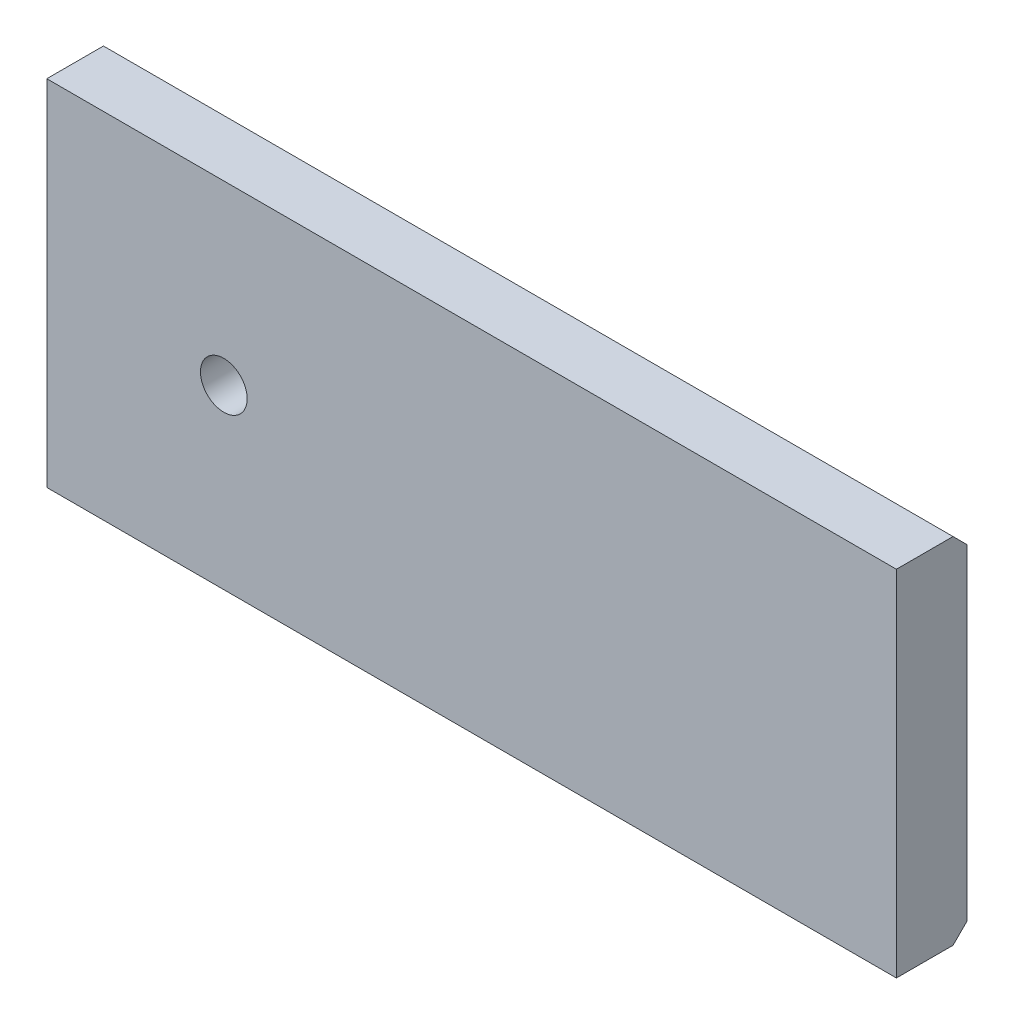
ISO-10303-21;
HEADER;
FILE_DESCRIPTION(('STEP AP214'),'2;1');
FILE_NAME('part.step','',(''),(''),'','','');
FILE_SCHEMA(('AUTOMOTIVE_DESIGN { 1 0 10303 214 1 1 1 1 }'));
ENDSEC;
DATA;
#1=APPLICATION_CONTEXT('core data for automotive mechanical design processes');
#2=APPLICATION_PROTOCOL_DEFINITION('international standard','automotive_design',2000,#1);
#3=PRODUCT_CONTEXT('',#1,'mechanical');
#4=PRODUCT('Part','Part','',(#3));
#5=PRODUCT_RELATED_PRODUCT_CATEGORY('part','',(#4));
#6=PRODUCT_DEFINITION_FORMATION('','',#4);
#7=PRODUCT_DEFINITION_CONTEXT('part definition',#1,'design');
#8=PRODUCT_DEFINITION('design','',#6,#7);
#9=PRODUCT_DEFINITION_SHAPE('','',#8);
#10=(LENGTH_UNIT() NAMED_UNIT(*) SI_UNIT(.MILLI.,.METRE.));
#11=(NAMED_UNIT(*) PLANE_ANGLE_UNIT() SI_UNIT($,.RADIAN.));
#12=(NAMED_UNIT(*) SI_UNIT($,.STERADIAN.) SOLID_ANGLE_UNIT());
#13=UNCERTAINTY_MEASURE_WITH_UNIT(LENGTH_MEASURE(1.E-05),#10,'distance_accuracy_value','');
#14=(GEOMETRIC_REPRESENTATION_CONTEXT(3) GLOBAL_UNCERTAINTY_ASSIGNED_CONTEXT((#13)) GLOBAL_UNIT_ASSIGNED_CONTEXT((#10,
#11,#12)) REPRESENTATION_CONTEXT('',''));
#15=CARTESIAN_POINT('',(0.,0.,0.));
#16=DIRECTION('',(0.,0.,1.));
#17=DIRECTION('',(1.,0.,0.));
#18=AXIS2_PLACEMENT_3D('',#15,#16,#17);
#19=CARTESIAN_POINT('',(0.,25.,10.));
#20=DIRECTION('',(1.,0.,0.));
#21=DIRECTION('',(0.,1.,0.));
#22=AXIS2_PLACEMENT_3D('',#19,#20,#21);
#23=PLANE('',#22);
#24=DIRECTION('',(0.,0.,-1.));
#25=VECTOR('',#24,1.);
#26=CARTESIAN_POINT('',(0.,25.,10.));
#27=LINE('',#26,#25);
#28=CARTESIAN_POINT('',(0.,25.,10.));
#29=VERTEX_POINT('',#28);
#30=CARTESIAN_POINT('',(0.,25.,2.00000000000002));
#31=VERTEX_POINT('',#30);
#32=EDGE_CURVE('E135',#29,#31,#27,.T.);
#33=ORIENTED_EDGE('',*,*,#32,.T.);
#34=DIRECTION('',(0.,0.707106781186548,0.707106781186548));
#35=VECTOR('',#34,1.);
#36=CARTESIAN_POINT('',(0.,25.,2.00000000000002));
#37=LINE('',#36,#35);
#38=CARTESIAN_POINT('',(0.,23.,0.));
#39=VERTEX_POINT('',#38);
#40=EDGE_CURVE('E121',#31,#39,#37,.F.);
#41=ORIENTED_EDGE('',*,*,#40,.T.);
#42=DIRECTION('',(0.,-1.,0.));
#43=VECTOR('',#42,1.);
#44=CARTESIAN_POINT('',(0.,25.,0.));
#45=LINE('',#44,#43);
#46=CARTESIAN_POINT('',(0.,-23.,0.));
#47=VERTEX_POINT('',#46);
#48=EDGE_CURVE('E137',#39,#47,#45,.T.);
#49=ORIENTED_EDGE('',*,*,#48,.T.);
#50=DIRECTION('',(0.,0.707106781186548,-0.707106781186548));
#51=VECTOR('',#50,1.);
#52=CARTESIAN_POINT('',(0.,-25.,2.00000000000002));
#53=LINE('',#52,#51);
#54=CARTESIAN_POINT('',(0.,-25.,2.00000000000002));
#55=VERTEX_POINT('',#54);
#56=EDGE_CURVE('E111',#47,#55,#53,.F.);
#57=ORIENTED_EDGE('',*,*,#56,.T.);
#58=DIRECTION('',(0.,0.,-1.));
#59=VECTOR('',#58,1.);
#60=CARTESIAN_POINT('',(0.,-25.,10.));
#61=LINE('',#60,#59);
#62=CARTESIAN_POINT('',(0.,-25.,10.));
#63=VERTEX_POINT('',#62);
#64=EDGE_CURVE('E92',#63,#55,#61,.T.);
#65=ORIENTED_EDGE('',*,*,#64,.F.);
#66=DIRECTION('',(0.,-1.,0.));
#67=VECTOR('',#66,1.);
#68=CARTESIAN_POINT('',(0.,25.,10.));
#69=LINE('',#68,#67);
#70=EDGE_CURVE('E98',#29,#63,#69,.T.);
#71=ORIENTED_EDGE('',*,*,#70,.F.);
#72=EDGE_LOOP('',(#33,#41,#49,#57,#65,#71));
#73=FACE_BOUND('',#72,.T.);
#74=ADVANCED_FACE('F33',(#73),#23,.F.);
#75=CARTESIAN_POINT('',(0.,-25.,10.));
#76=DIRECTION('',(0.,1.,0.));
#77=DIRECTION('',(0.,0.,1.));
#78=AXIS2_PLACEMENT_3D('',#75,#76,#77);
#79=PLANE('',#78);
#80=ORIENTED_EDGE('',*,*,#64,.T.);
#81=DIRECTION('',(1.,0.,0.));
#82=VECTOR('',#81,1.);
#83=CARTESIAN_POINT('',(0.,-25.,2.00000000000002));
#84=LINE('',#83,#82);
#85=CARTESIAN_POINT('',(120.,-25.,2.00000000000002));
#86=VERTEX_POINT('',#85);
#87=EDGE_CURVE('E11',#55,#86,#84,.T.);
#88=ORIENTED_EDGE('',*,*,#87,.T.);
#89=DIRECTION('',(0.,0.,-1.));
#90=VECTOR('',#89,1.);
#91=CARTESIAN_POINT('',(120.,-25.,10.));
#92=LINE('',#91,#90);
#93=CARTESIAN_POINT('',(120.,-25.,10.));
#94=VERTEX_POINT('',#93);
#95=EDGE_CURVE('E94',#94,#86,#92,.T.);
#96=ORIENTED_EDGE('',*,*,#95,.F.);
#97=DIRECTION('',(1.,0.,0.));
#98=VECTOR('',#97,1.);
#99=CARTESIAN_POINT('',(0.,-25.,10.));
#100=LINE('',#99,#98);
#101=EDGE_CURVE('E88',#63,#94,#100,.T.);
#102=ORIENTED_EDGE('',*,*,#101,.F.);
#103=EDGE_LOOP('',(#80,#88,#96,#102));
#104=FACE_BOUND('',#103,.T.);
#105=ADVANCED_FACE('F90',(#104),#79,.F.);
#106=CARTESIAN_POINT('',(120.,25.,10.));
#107=DIRECTION('',(-1.,0.,0.));
#108=DIRECTION('',(0.,0.,1.));
#109=AXIS2_PLACEMENT_3D('',#106,#107,#108);
#110=PLANE('',#109);
#111=DIRECTION('',(0.,1.,0.));
#112=VECTOR('',#111,1.);
#113=CARTESIAN_POINT('',(120.,25.,0.));
#114=LINE('',#113,#112);
#115=CARTESIAN_POINT('',(120.,-23.,0.));
#116=VERTEX_POINT('',#115);
#117=CARTESIAN_POINT('',(120.,23.,0.));
#118=VERTEX_POINT('',#117);
#119=EDGE_CURVE('E107',#116,#118,#114,.T.);
#120=ORIENTED_EDGE('',*,*,#119,.T.);
#121=DIRECTION('',(0.,-0.707106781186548,-0.707106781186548));
#122=VECTOR('',#121,1.);
#123=CARTESIAN_POINT('',(120.,25.,2.00000000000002));
#124=LINE('',#123,#122);
#125=CARTESIAN_POINT('',(120.,25.,2.00000000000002));
#126=VERTEX_POINT('',#125);
#127=EDGE_CURVE('E41',#118,#126,#124,.F.);
#128=ORIENTED_EDGE('',*,*,#127,.T.);
#129=DIRECTION('',(0.,0.,-1.));
#130=VECTOR('',#129,1.);
#131=CARTESIAN_POINT('',(120.,25.,10.));
#132=LINE('',#131,#130);
#133=CARTESIAN_POINT('',(120.,25.,10.));
#134=VERTEX_POINT('',#133);
#135=EDGE_CURVE('E116',#134,#126,#132,.T.);
#136=ORIENTED_EDGE('',*,*,#135,.F.);
#137=DIRECTION('',(0.,1.,0.));
#138=VECTOR('',#137,1.);
#139=CARTESIAN_POINT('',(120.,25.,10.));
#140=LINE('',#139,#138);
#141=EDGE_CURVE('E97',#94,#134,#140,.T.);
#142=ORIENTED_EDGE('',*,*,#141,.F.);
#143=ORIENTED_EDGE('',*,*,#95,.T.);
#144=DIRECTION('',(0.,-0.707106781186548,0.707106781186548));
#145=VECTOR('',#144,1.);
#146=CARTESIAN_POINT('',(120.,-25.,2.00000000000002));
#147=LINE('',#146,#145);
#148=EDGE_CURVE('E48',#86,#116,#147,.F.);
#149=ORIENTED_EDGE('',*,*,#148,.T.);
#150=EDGE_LOOP('',(#120,#128,#136,#142,#143,#149));
#151=FACE_BOUND('',#150,.T.);
#152=ADVANCED_FACE('F130',(#151),#110,.F.);
#153=CARTESIAN_POINT('',(0.,25.,10.));
#154=DIRECTION('',(0.,-1.,0.));
#155=DIRECTION('',(0.,0.,-1.));
#156=AXIS2_PLACEMENT_3D('',#153,#154,#155);
#157=PLANE('',#156);
#158=ORIENTED_EDGE('',*,*,#135,.T.);
#159=DIRECTION('',(-1.,0.,0.));
#160=VECTOR('',#159,1.);
#161=CARTESIAN_POINT('',(0.,25.,2.00000000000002));
#162=LINE('',#161,#160);
#163=EDGE_CURVE('E112',#126,#31,#162,.T.);
#164=ORIENTED_EDGE('',*,*,#163,.T.);
#165=ORIENTED_EDGE('',*,*,#32,.F.);
#166=DIRECTION('',(-1.,0.,0.));
#167=VECTOR('',#166,1.);
#168=CARTESIAN_POINT('',(0.,25.,10.));
#169=LINE('',#168,#167);
#170=EDGE_CURVE('E103',#134,#29,#169,.T.);
#171=ORIENTED_EDGE('',*,*,#170,.F.);
#172=EDGE_LOOP('',(#158,#164,#165,#171));
#173=FACE_BOUND('',#172,.T.);
#174=ADVANCED_FACE('F134',(#173),#157,.F.);
#175=CARTESIAN_POINT('',(0.,-25.,10.));
#176=DIRECTION('',(0.,0.,1.));
#177=DIRECTION('',(1.,0.,0.));
#178=AXIS2_PLACEMENT_3D('',#175,#176,#177);
#179=PLANE('',#178);
#180=CARTESIAN_POINT('',(25.,0.,10.));
#181=DIRECTION('',(0.,0.,-1.));
#182=DIRECTION('',(-1.,0.,0.));
#183=AXIS2_PLACEMENT_3D('',#180,#181,#182);
#184=CIRCLE('',#183,3.29919263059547);
#185=CARTESIAN_POINT('',(21.7008073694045,0.,10.));
#186=VERTEX_POINT('',#185);
#187=EDGE_CURVE('E139',#186,#186,#184,.T.);
#188=ORIENTED_EDGE('',*,*,#187,.T.);
#189=EDGE_LOOP('',(#188));
#190=FACE_BOUND('',#189,.T.);
#191=ORIENTED_EDGE('',*,*,#70,.T.);
#192=ORIENTED_EDGE('',*,*,#101,.T.);
#193=ORIENTED_EDGE('',*,*,#141,.T.);
#194=ORIENTED_EDGE('',*,*,#170,.T.);
#195=EDGE_LOOP('',(#191,#192,#193,#194));
#196=FACE_BOUND('',#195,.T.);
#197=ADVANCED_FACE('F101',(#190,#196),#179,.T.);
#198=CARTESIAN_POINT('',(0.,-25.,0.));
#199=DIRECTION('',(0.,0.,1.));
#200=DIRECTION('',(1.,0.,0.));
#201=AXIS2_PLACEMENT_3D('',#198,#199,#200);
#202=PLANE('',#201);
#203=CARTESIAN_POINT('',(25.,0.,0.));
#204=DIRECTION('',(0.,0.,-1.));
#205=DIRECTION('',(-1.,0.,0.));
#206=AXIS2_PLACEMENT_3D('',#203,#204,#205);
#207=CIRCLE('',#206,3.29919263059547);
#208=CARTESIAN_POINT('',(21.7008073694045,0.,0.));
#209=VERTEX_POINT('',#208);
#210=EDGE_CURVE('E143',#209,#209,#207,.T.);
#211=ORIENTED_EDGE('',*,*,#210,.F.);
#212=EDGE_LOOP('',(#211));
#213=FACE_BOUND('',#212,.T.);
#214=ORIENTED_EDGE('',*,*,#48,.F.);
#215=DIRECTION('',(1.,0.,0.));
#216=VECTOR('',#215,1.);
#217=CARTESIAN_POINT('',(0.,23.,0.));
#218=LINE('',#217,#216);
#219=EDGE_CURVE('E55',#39,#118,#218,.T.);
#220=ORIENTED_EDGE('',*,*,#219,.T.);
#221=ORIENTED_EDGE('',*,*,#119,.F.);
#222=DIRECTION('',(-1.,0.,0.));
#223=VECTOR('',#222,1.);
#224=CARTESIAN_POINT('',(0.,-23.,0.));
#225=LINE('',#224,#223);
#226=EDGE_CURVE('E123',#116,#47,#225,.T.);
#227=ORIENTED_EDGE('',*,*,#226,.T.);
#228=EDGE_LOOP('',(#214,#220,#221,#227));
#229=FACE_BOUND('',#228,.T.);
#230=ADVANCED_FACE('F138',(#213,#229),#202,.F.);
#231=CARTESIAN_POINT('',(25.,0.,10.));
#232=DIRECTION('',(0.,0.,-1.));
#233=DIRECTION('',(-1.,0.,0.));
#234=AXIS2_PLACEMENT_3D('',#231,#232,#233);
#235=CYLINDRICAL_SURFACE('',#234,3.29919263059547);
#236=ORIENTED_EDGE('',*,*,#187,.F.);
#237=EDGE_LOOP('',(#236));
#238=FACE_BOUND('',#237,.T.);
#239=ORIENTED_EDGE('',*,*,#210,.T.);
#240=EDGE_LOOP('',(#239));
#241=FACE_BOUND('',#240,.T.);
#242=ADVANCED_FACE('F152',(#238,#241),#235,.F.);
#243=CARTESIAN_POINT('',(0.,25.,2.00000000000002));
#244=DIRECTION('',(0.,-0.707106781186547,0.707106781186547));
#245=DIRECTION('',(0.,-0.707106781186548,-0.707106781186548));
#246=AXIS2_PLACEMENT_3D('',#243,#244,#245);
#247=PLANE('',#246);
#248=ORIENTED_EDGE('',*,*,#127,.F.);
#249=ORIENTED_EDGE('',*,*,#219,.F.);
#250=ORIENTED_EDGE('',*,*,#40,.F.);
#251=ORIENTED_EDGE('',*,*,#163,.F.);
#252=EDGE_LOOP('',(#248,#249,#250,#251));
#253=FACE_BOUND('',#252,.T.);
#254=ADVANCED_FACE('F136',(#253),#247,.F.);
#255=CARTESIAN_POINT('',(0.,-25.,2.00000000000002));
#256=DIRECTION('',(0.,0.707106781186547,0.707106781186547));
#257=DIRECTION('',(0.,-0.707106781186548,0.707106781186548));
#258=AXIS2_PLACEMENT_3D('',#255,#256,#257);
#259=PLANE('',#258);
#260=ORIENTED_EDGE('',*,*,#56,.F.);
#261=ORIENTED_EDGE('',*,*,#226,.F.);
#262=ORIENTED_EDGE('',*,*,#148,.F.);
#263=ORIENTED_EDGE('',*,*,#87,.F.);
#264=EDGE_LOOP('',(#260,#261,#262,#263));
#265=FACE_BOUND('',#264,.T.);
#266=ADVANCED_FACE('F35',(#265),#259,.F.);
#267=CLOSED_SHELL('',(#74,#105,#152,#174,#197,#230,#242,#254,#266));
#268=MANIFOLD_SOLID_BREP('B2',#267);
#269=ADVANCED_BREP_SHAPE_REPRESENTATION('',(#18,#268),#14);
#270=SHAPE_DEFINITION_REPRESENTATION(#9,#269);
ENDSEC;
END-ISO-10303-21;
